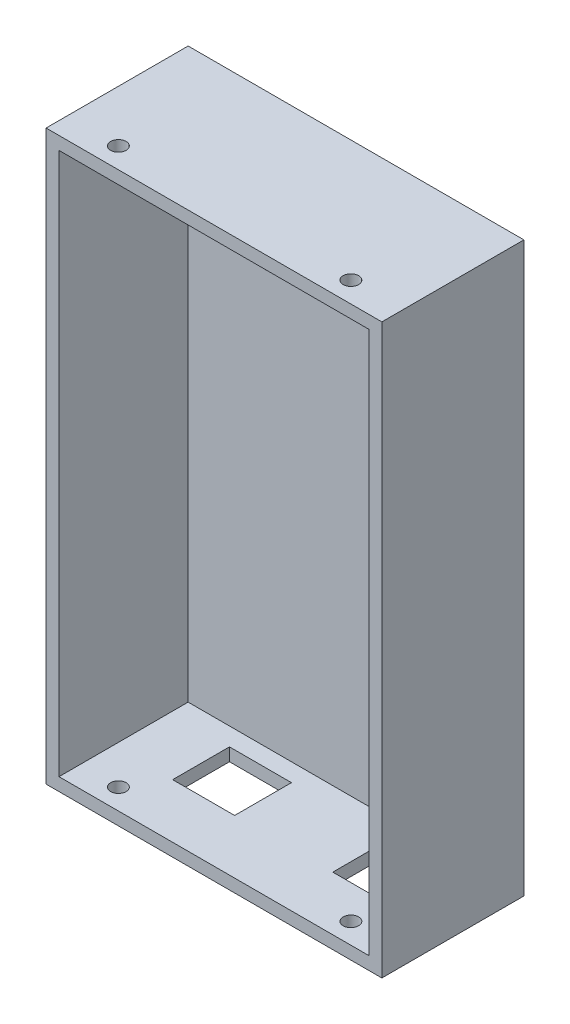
ISO-10303-21;
HEADER;
FILE_DESCRIPTION(('STEP AP214'),'2;1');
FILE_NAME('part.step','',(''),(''),'','','');
FILE_SCHEMA(('AUTOMOTIVE_DESIGN { 1 0 10303 214 1 1 1 1 }'));
ENDSEC;
DATA;
#1=APPLICATION_CONTEXT('core data for automotive mechanical design processes');
#2=APPLICATION_PROTOCOL_DEFINITION('international standard','automotive_design',2000,#1);
#3=PRODUCT_CONTEXT('',#1,'mechanical');
#4=PRODUCT('Part','Part','',(#3));
#5=PRODUCT_RELATED_PRODUCT_CATEGORY('part','',(#4));
#6=PRODUCT_DEFINITION_FORMATION('','',#4);
#7=PRODUCT_DEFINITION_CONTEXT('part definition',#1,'design');
#8=PRODUCT_DEFINITION('design','',#6,#7);
#9=PRODUCT_DEFINITION_SHAPE('','',#8);
#10=(LENGTH_UNIT() NAMED_UNIT(*) SI_UNIT(.MILLI.,.METRE.));
#11=(NAMED_UNIT(*) PLANE_ANGLE_UNIT() SI_UNIT($,.RADIAN.));
#12=(NAMED_UNIT(*) SI_UNIT($,.STERADIAN.) SOLID_ANGLE_UNIT());
#13=UNCERTAINTY_MEASURE_WITH_UNIT(LENGTH_MEASURE(1.E-05),#10,'distance_accuracy_value','');
#14=(GEOMETRIC_REPRESENTATION_CONTEXT(3) GLOBAL_UNCERTAINTY_ASSIGNED_CONTEXT((#13)) GLOBAL_UNIT_ASSIGNED_CONTEXT((#10,
#11,#12)) REPRESENTATION_CONTEXT('',''));
#15=CARTESIAN_POINT('',(0.,0.,0.));
#16=DIRECTION('',(0.,0.,1.));
#17=DIRECTION('',(1.,0.,0.));
#18=AXIS2_PLACEMENT_3D('',#15,#16,#17);
#19=CARTESIAN_POINT('',(32.5,55.,2.5));
#20=DIRECTION('',(-1.,0.,0.));
#21=DIRECTION('',(0.,-1.,0.));
#22=AXIS2_PLACEMENT_3D('',#19,#20,#21);
#23=PLANE('',#22);
#24=DIRECTION('',(0.,1.,0.));
#25=VECTOR('',#24,1.);
#26=CARTESIAN_POINT('',(32.5,55.,0.));
#27=LINE('',#26,#25);
#28=CARTESIAN_POINT('',(32.5,-55.,0.));
#29=VERTEX_POINT('',#28);
#30=CARTESIAN_POINT('',(32.5,55.,0.));
#31=VERTEX_POINT('',#30);
#32=EDGE_CURVE('E245',#29,#31,#27,.T.);
#33=ORIENTED_EDGE('',*,*,#32,.T.);
#34=DIRECTION('',(0.,0.,-1.));
#35=VECTOR('',#34,1.);
#36=CARTESIAN_POINT('',(32.5,55.,2.5));
#37=LINE('',#36,#35);
#38=CARTESIAN_POINT('',(32.5,55.,27.5));
#39=VERTEX_POINT('',#38);
#40=EDGE_CURVE('E263',#39,#31,#37,.T.);
#41=ORIENTED_EDGE('',*,*,#40,.F.);
#42=DIRECTION('',(0.,1.,0.));
#43=VECTOR('',#42,1.);
#44=CARTESIAN_POINT('',(32.5,-55.,27.5));
#45=LINE('',#44,#43);
#46=CARTESIAN_POINT('',(32.5,-55.,27.5));
#47=VERTEX_POINT('',#46);
#48=EDGE_CURVE('E242',#47,#39,#45,.T.);
#49=ORIENTED_EDGE('',*,*,#48,.F.);
#50=DIRECTION('',(0.,0.,-1.));
#51=VECTOR('',#50,1.);
#52=CARTESIAN_POINT('',(32.5,-55.,2.5));
#53=LINE('',#52,#51);
#54=EDGE_CURVE('E254',#47,#29,#53,.T.);
#55=ORIENTED_EDGE('',*,*,#54,.T.);
#56=EDGE_LOOP('',(#33,#41,#49,#55));
#57=FACE_BOUND('',#56,.T.);
#58=ADVANCED_FACE('F39',(#57),#23,.F.);
#59=CARTESIAN_POINT('',(-32.5,55.,2.5));
#60=DIRECTION('',(0.,-1.,0.));
#61=DIRECTION('',(0.,0.,-1.));
#62=AXIS2_PLACEMENT_3D('',#59,#60,#61);
#63=PLANE('',#62);
#64=CARTESIAN_POINT('',(-22.5,55.,23.5));
#65=DIRECTION('',(0.,-1.,0.));
#66=DIRECTION('',(0.,0.,-1.));
#67=AXIS2_PLACEMENT_3D('',#64,#65,#66);
#68=CIRCLE('',#67,1.5);
#69=CARTESIAN_POINT('',(-22.5,55.,22.));
#70=VERTEX_POINT('',#69);
#71=EDGE_CURVE('E281',#70,#70,#68,.T.);
#72=ORIENTED_EDGE('',*,*,#71,.T.);
#73=EDGE_LOOP('',(#72));
#74=FACE_BOUND('',#73,.T.);
#75=CARTESIAN_POINT('',(22.5,55.,23.5));
#76=DIRECTION('',(0.,-1.,0.));
#77=DIRECTION('',(0.,0.,-1.));
#78=AXIS2_PLACEMENT_3D('',#75,#76,#77);
#79=CIRCLE('',#78,1.5);
#80=CARTESIAN_POINT('',(22.5,55.,22.));
#81=VERTEX_POINT('',#80);
#82=EDGE_CURVE('E297',#81,#81,#79,.T.);
#83=ORIENTED_EDGE('',*,*,#82,.T.);
#84=EDGE_LOOP('',(#83));
#85=FACE_BOUND('',#84,.T.);
#86=DIRECTION('',(-1.,0.,0.));
#87=VECTOR('',#86,1.);
#88=CARTESIAN_POINT('',(-32.5,55.,0.));
#89=LINE('',#88,#87);
#90=CARTESIAN_POINT('',(-32.5,55.,0.));
#91=VERTEX_POINT('',#90);
#92=EDGE_CURVE('E248',#31,#91,#89,.T.);
#93=ORIENTED_EDGE('',*,*,#92,.T.);
#94=DIRECTION('',(0.,0.,-1.));
#95=VECTOR('',#94,1.);
#96=CARTESIAN_POINT('',(-32.5,55.,2.5));
#97=LINE('',#96,#95);
#98=CARTESIAN_POINT('',(-32.5,55.,27.5));
#99=VERTEX_POINT('',#98);
#100=EDGE_CURVE('E260',#99,#91,#97,.T.);
#101=ORIENTED_EDGE('',*,*,#100,.F.);
#102=DIRECTION('',(-1.,0.,0.));
#103=VECTOR('',#102,1.);
#104=CARTESIAN_POINT('',(32.5,55.,27.5));
#105=LINE('',#104,#103);
#106=EDGE_CURVE('E233',#39,#99,#105,.T.);
#107=ORIENTED_EDGE('',*,*,#106,.F.);
#108=ORIENTED_EDGE('',*,*,#40,.T.);
#109=EDGE_LOOP('',(#93,#101,#107,#108));
#110=FACE_BOUND('',#109,.T.);
#111=ADVANCED_FACE('F355',(#74,#85,#110),#63,.F.);
#112=CARTESIAN_POINT('',(-32.5,55.,2.5));
#113=DIRECTION('',(1.,0.,0.));
#114=DIRECTION('',(0.,1.,0.));
#115=AXIS2_PLACEMENT_3D('',#112,#113,#114);
#116=PLANE('',#115);
#117=DIRECTION('',(0.,-1.,0.));
#118=VECTOR('',#117,1.);
#119=CARTESIAN_POINT('',(-32.5,55.,0.));
#120=LINE('',#119,#118);
#121=CARTESIAN_POINT('',(-32.5,-55.,0.));
#122=VERTEX_POINT('',#121);
#123=EDGE_CURVE('E250',#91,#122,#120,.T.);
#124=ORIENTED_EDGE('',*,*,#123,.T.);
#125=DIRECTION('',(0.,0.,-1.));
#126=VECTOR('',#125,1.);
#127=CARTESIAN_POINT('',(-32.5,-55.,2.5));
#128=LINE('',#127,#126);
#129=CARTESIAN_POINT('',(-32.5,-55.,27.5));
#130=VERTEX_POINT('',#129);
#131=EDGE_CURVE('E257',#130,#122,#128,.T.);
#132=ORIENTED_EDGE('',*,*,#131,.F.);
#133=DIRECTION('',(0.,-1.,0.));
#134=VECTOR('',#133,1.);
#135=CARTESIAN_POINT('',(-32.5,55.,27.5));
#136=LINE('',#135,#134);
#137=EDGE_CURVE('E236',#99,#130,#136,.T.);
#138=ORIENTED_EDGE('',*,*,#137,.F.);
#139=ORIENTED_EDGE('',*,*,#100,.T.);
#140=EDGE_LOOP('',(#124,#132,#138,#139));
#141=FACE_BOUND('',#140,.T.);
#142=ADVANCED_FACE('F360',(#141),#116,.F.);
#143=CARTESIAN_POINT('',(-32.5,-55.,2.5));
#144=DIRECTION('',(0.,1.,0.));
#145=DIRECTION('',(0.,0.,1.));
#146=AXIS2_PLACEMENT_3D('',#143,#144,#145);
#147=PLANE('',#146);
#148=CARTESIAN_POINT('',(-22.5,-55.,23.5));
#149=DIRECTION('',(0.,-1.,0.));
#150=DIRECTION('',(0.,0.,-1.));
#151=AXIS2_PLACEMENT_3D('',#148,#149,#150);
#152=CIRCLE('',#151,1.5);
#153=CARTESIAN_POINT('',(-22.5,-55.,22.));
#154=VERTEX_POINT('',#153);
#155=EDGE_CURVE('E287',#154,#154,#152,.T.);
#156=ORIENTED_EDGE('',*,*,#155,.F.);
#157=EDGE_LOOP('',(#156));
#158=FACE_BOUND('',#157,.T.);
#159=CARTESIAN_POINT('',(22.5,-55.,23.5));
#160=DIRECTION('',(0.,-1.,0.));
#161=DIRECTION('',(0.,0.,-1.));
#162=AXIS2_PLACEMENT_3D('',#159,#160,#161);
#163=CIRCLE('',#162,1.5);
#164=CARTESIAN_POINT('',(22.5,-55.,22.));
#165=VERTEX_POINT('',#164);
#166=EDGE_CURVE('E292',#165,#165,#163,.T.);
#167=ORIENTED_EDGE('',*,*,#166,.F.);
#168=EDGE_LOOP('',(#167));
#169=FACE_BOUND('',#168,.T.);
#170=DIRECTION('',(-1.,0.,0.));
#171=VECTOR('',#170,1.);
#172=CARTESIAN_POINT('',(-18.5,-55.,17.));
#173=LINE('',#172,#171);
#174=CARTESIAN_POINT('',(-6.49999999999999,-55.,17.));
#175=VERTEX_POINT('',#174);
#176=CARTESIAN_POINT('',(-18.5,-55.,17.));
#177=VERTEX_POINT('',#176);
#178=EDGE_CURVE('E169',#175,#177,#173,.T.);
#179=ORIENTED_EDGE('',*,*,#178,.F.);
#180=DIRECTION('',(0.,0.,1.));
#181=VECTOR('',#180,1.);
#182=CARTESIAN_POINT('',(-6.49999999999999,-55.,17.));
#183=LINE('',#182,#181);
#184=CARTESIAN_POINT('',(-6.49999999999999,-55.,6.));
#185=VERTEX_POINT('',#184);
#186=EDGE_CURVE('E55',#185,#175,#183,.T.);
#187=ORIENTED_EDGE('',*,*,#186,.F.);
#188=DIRECTION('',(1.,0.,0.));
#189=VECTOR('',#188,1.);
#190=CARTESIAN_POINT('',(-18.5,-55.,6.));
#191=LINE('',#190,#189);
#192=CARTESIAN_POINT('',(-18.5,-55.,6.));
#193=VERTEX_POINT('',#192);
#194=EDGE_CURVE('E176',#193,#185,#191,.T.);
#195=ORIENTED_EDGE('',*,*,#194,.F.);
#196=DIRECTION('',(0.,0.,-1.));
#197=VECTOR('',#196,1.);
#198=CARTESIAN_POINT('',(-18.5,-55.,6.));
#199=LINE('',#198,#197);
#200=EDGE_CURVE('E159',#177,#193,#199,.T.);
#201=ORIENTED_EDGE('',*,*,#200,.F.);
#202=EDGE_LOOP('',(#179,#187,#195,#201));
#203=FACE_BOUND('',#202,.T.);
#204=DIRECTION('',(0.,0.,1.));
#205=VECTOR('',#204,1.);
#206=CARTESIAN_POINT('',(22.,-55.,6.));
#207=LINE('',#206,#205);
#208=CARTESIAN_POINT('',(22.,-55.,6.));
#209=VERTEX_POINT('',#208);
#210=CARTESIAN_POINT('',(22.,-55.,17.));
#211=VERTEX_POINT('',#210);
#212=EDGE_CURVE('E201',#209,#211,#207,.T.);
#213=ORIENTED_EDGE('',*,*,#212,.F.);
#214=DIRECTION('',(1.,0.,0.));
#215=VECTOR('',#214,1.);
#216=CARTESIAN_POINT('',(12.5,-55.,6.));
#217=LINE('',#216,#215);
#218=CARTESIAN_POINT('',(12.5,-55.,6.));
#219=VERTEX_POINT('',#218);
#220=EDGE_CURVE('E63',#219,#209,#217,.T.);
#221=ORIENTED_EDGE('',*,*,#220,.F.);
#222=DIRECTION('',(0.,0.,-1.));
#223=VECTOR('',#222,1.);
#224=CARTESIAN_POINT('',(12.5,-55.,17.));
#225=LINE('',#224,#223);
#226=CARTESIAN_POINT('',(12.5,-55.,17.));
#227=VERTEX_POINT('',#226);
#228=EDGE_CURVE('E188',#227,#219,#225,.T.);
#229=ORIENTED_EDGE('',*,*,#228,.F.);
#230=DIRECTION('',(-1.,0.,0.));
#231=VECTOR('',#230,1.);
#232=CARTESIAN_POINT('',(22.,-55.,17.));
#233=LINE('',#232,#231);
#234=EDGE_CURVE('E198',#211,#227,#233,.T.);
#235=ORIENTED_EDGE('',*,*,#234,.F.);
#236=EDGE_LOOP('',(#213,#221,#229,#235));
#237=FACE_BOUND('',#236,.T.);
#238=DIRECTION('',(1.,0.,0.));
#239=VECTOR('',#238,1.);
#240=CARTESIAN_POINT('',(-32.5,-55.,0.));
#241=LINE('',#240,#239);
#242=EDGE_CURVE('E252',#122,#29,#241,.T.);
#243=ORIENTED_EDGE('',*,*,#242,.T.);
#244=ORIENTED_EDGE('',*,*,#54,.F.);
#245=DIRECTION('',(1.,0.,0.));
#246=VECTOR('',#245,1.);
#247=CARTESIAN_POINT('',(-32.5,-55.,27.5));
#248=LINE('',#247,#246);
#249=EDGE_CURVE('E239',#130,#47,#248,.T.);
#250=ORIENTED_EDGE('',*,*,#249,.F.);
#251=ORIENTED_EDGE('',*,*,#131,.T.);
#252=EDGE_LOOP('',(#243,#244,#250,#251));
#253=FACE_BOUND('',#252,.T.);
#254=ADVANCED_FACE('F173',(#158,#169,#203,#237,#253),#147,.F.);
#255=CARTESIAN_POINT('',(0.,0.,0.));
#256=DIRECTION('',(0.,0.,1.));
#257=DIRECTION('',(1.,0.,0.));
#258=AXIS2_PLACEMENT_3D('',#255,#256,#257);
#259=PLANE('',#258);
#260=ORIENTED_EDGE('',*,*,#32,.F.);
#261=ORIENTED_EDGE('',*,*,#242,.F.);
#262=ORIENTED_EDGE('',*,*,#123,.F.);
#263=ORIENTED_EDGE('',*,*,#92,.F.);
#264=EDGE_LOOP('',(#260,#261,#262,#263));
#265=FACE_BOUND('',#264,.T.);
#266=ADVANCED_FACE('F350',(#265),#259,.F.);
#267=CARTESIAN_POINT('',(0.,0.,27.5));
#268=DIRECTION('',(0.,0.,1.));
#269=DIRECTION('',(1.,0.,0.));
#270=AXIS2_PLACEMENT_3D('',#267,#268,#269);
#271=PLANE('',#270);
#272=ORIENTED_EDGE('',*,*,#106,.T.);
#273=ORIENTED_EDGE('',*,*,#137,.T.);
#274=ORIENTED_EDGE('',*,*,#249,.T.);
#275=ORIENTED_EDGE('',*,*,#48,.T.);
#276=EDGE_LOOP('',(#272,#273,#274,#275));
#277=FACE_BOUND('',#276,.T.);
#278=DIRECTION('',(0.,-1.,0.));
#279=VECTOR('',#278,1.);
#280=CARTESIAN_POINT('',(-30.,52.5,27.5));
#281=LINE('',#280,#279);
#282=CARTESIAN_POINT('',(-30.,52.5,27.5));
#283=VERTEX_POINT('',#282);
#284=CARTESIAN_POINT('',(-30.,-52.5,27.5));
#285=VERTEX_POINT('',#284);
#286=EDGE_CURVE('E207',#283,#285,#281,.T.);
#287=ORIENTED_EDGE('',*,*,#286,.F.);
#288=DIRECTION('',(-1.,0.,0.));
#289=VECTOR('',#288,1.);
#290=CARTESIAN_POINT('',(30.,52.5,27.5));
#291=LINE('',#290,#289);
#292=CARTESIAN_POINT('',(30.,52.5,27.5));
#293=VERTEX_POINT('',#292);
#294=EDGE_CURVE('E205',#293,#283,#291,.T.);
#295=ORIENTED_EDGE('',*,*,#294,.F.);
#296=DIRECTION('',(0.,1.,0.));
#297=VECTOR('',#296,1.);
#298=CARTESIAN_POINT('',(30.,-52.5,27.5));
#299=LINE('',#298,#297);
#300=CARTESIAN_POINT('',(30.,-52.5,27.5));
#301=VERTEX_POINT('',#300);
#302=EDGE_CURVE('E213',#301,#293,#299,.T.);
#303=ORIENTED_EDGE('',*,*,#302,.F.);
#304=DIRECTION('',(1.,0.,0.));
#305=VECTOR('',#304,1.);
#306=CARTESIAN_POINT('',(-30.,-52.5,27.5));
#307=LINE('',#306,#305);
#308=EDGE_CURVE('E210',#285,#301,#307,.T.);
#309=ORIENTED_EDGE('',*,*,#308,.F.);
#310=EDGE_LOOP('',(#287,#295,#303,#309));
#311=FACE_BOUND('',#310,.T.);
#312=ADVANCED_FACE('F336',(#277,#311),#271,.T.);
#313=CARTESIAN_POINT('',(30.,52.5,27.5));
#314=DIRECTION('',(0.,-1.,0.));
#315=DIRECTION('',(0.,0.,-1.));
#316=AXIS2_PLACEMENT_3D('',#313,#314,#315);
#317=PLANE('',#316);
#318=CARTESIAN_POINT('',(-22.5,52.5,23.5));
#319=DIRECTION('',(0.,-1.,0.));
#320=DIRECTION('',(0.,0.,-1.));
#321=AXIS2_PLACEMENT_3D('',#318,#319,#320);
#322=CIRCLE('',#321,1.5);
#323=CARTESIAN_POINT('',(-22.5,52.5,22.));
#324=VERTEX_POINT('',#323);
#325=EDGE_CURVE('E195',#324,#324,#322,.T.);
#326=ORIENTED_EDGE('',*,*,#325,.F.);
#327=EDGE_LOOP('',(#326));
#328=FACE_BOUND('',#327,.T.);
#329=CARTESIAN_POINT('',(22.5,52.5,23.5));
#330=DIRECTION('',(0.,-1.,0.));
#331=DIRECTION('',(0.,0.,-1.));
#332=AXIS2_PLACEMENT_3D('',#329,#330,#331);
#333=CIRCLE('',#332,1.5);
#334=CARTESIAN_POINT('',(22.5,52.5,22.));
#335=VERTEX_POINT('',#334);
#336=EDGE_CURVE('E280',#335,#335,#333,.T.);
#337=ORIENTED_EDGE('',*,*,#336,.F.);
#338=EDGE_LOOP('',(#337));
#339=FACE_BOUND('',#338,.T.);
#340=DIRECTION('',(-1.,0.,0.));
#341=VECTOR('',#340,1.);
#342=CARTESIAN_POINT('',(30.,52.5,2.5));
#343=LINE('',#342,#341);
#344=CARTESIAN_POINT('',(30.,52.5,2.5));
#345=VERTEX_POINT('',#344);
#346=CARTESIAN_POINT('',(-30.,52.5,2.5));
#347=VERTEX_POINT('',#346);
#348=EDGE_CURVE('E183',#345,#347,#343,.T.);
#349=ORIENTED_EDGE('',*,*,#348,.F.);
#350=DIRECTION('',(0.,0.,-1.));
#351=VECTOR('',#350,1.);
#352=CARTESIAN_POINT('',(30.,52.5,27.5));
#353=LINE('',#352,#351);
#354=EDGE_CURVE('E215',#293,#345,#353,.T.);
#355=ORIENTED_EDGE('',*,*,#354,.F.);
#356=ORIENTED_EDGE('',*,*,#294,.T.);
#357=DIRECTION('',(0.,0.,-1.));
#358=VECTOR('',#357,1.);
#359=CARTESIAN_POINT('',(-30.,52.5,27.5));
#360=LINE('',#359,#358);
#361=EDGE_CURVE('E230',#283,#347,#360,.T.);
#362=ORIENTED_EDGE('',*,*,#361,.T.);
#363=EDGE_LOOP('',(#349,#355,#356,#362));
#364=FACE_BOUND('',#363,.T.);
#365=ADVANCED_FACE('F341',(#328,#339,#364),#317,.T.);
#366=CARTESIAN_POINT('',(-30.,52.5,27.5));
#367=DIRECTION('',(1.,0.,0.));
#368=DIRECTION('',(0.,1.,0.));
#369=AXIS2_PLACEMENT_3D('',#366,#367,#368);
#370=PLANE('',#369);
#371=DIRECTION('',(0.,-1.,0.));
#372=VECTOR('',#371,1.);
#373=CARTESIAN_POINT('',(-30.,52.5,2.5));
#374=LINE('',#373,#372);
#375=CARTESIAN_POINT('',(-30.,-52.5,2.5));
#376=VERTEX_POINT('',#375);
#377=EDGE_CURVE('E217',#347,#376,#374,.T.);
#378=ORIENTED_EDGE('',*,*,#377,.F.);
#379=ORIENTED_EDGE('',*,*,#361,.F.);
#380=ORIENTED_EDGE('',*,*,#286,.T.);
#381=DIRECTION('',(0.,0.,-1.));
#382=VECTOR('',#381,1.);
#383=CARTESIAN_POINT('',(-30.,-52.5,27.5));
#384=LINE('',#383,#382);
#385=EDGE_CURVE('E227',#285,#376,#384,.T.);
#386=ORIENTED_EDGE('',*,*,#385,.T.);
#387=EDGE_LOOP('',(#378,#379,#380,#386));
#388=FACE_BOUND('',#387,.T.);
#389=ADVANCED_FACE('F313',(#388),#370,.T.);
#390=CARTESIAN_POINT('',(-30.,-52.5,27.5));
#391=DIRECTION('',(0.,1.,0.));
#392=DIRECTION('',(0.,0.,1.));
#393=AXIS2_PLACEMENT_3D('',#390,#391,#392);
#394=PLANE('',#393);
#395=CARTESIAN_POINT('',(-22.5,-52.5,23.5));
#396=DIRECTION('',(0.,1.,0.));
#397=DIRECTION('',(0.,0.,1.));
#398=AXIS2_PLACEMENT_3D('',#395,#396,#397);
#399=CIRCLE('',#398,1.5);
#400=CARTESIAN_POINT('',(-22.5,-52.5,25.));
#401=VERTEX_POINT('',#400);
#402=EDGE_CURVE('E42',#401,#401,#399,.T.);
#403=ORIENTED_EDGE('',*,*,#402,.F.);
#404=EDGE_LOOP('',(#403));
#405=FACE_BOUND('',#404,.T.);
#406=CARTESIAN_POINT('',(22.5,-52.5,23.5));
#407=DIRECTION('',(0.,1.,0.));
#408=DIRECTION('',(0.,0.,1.));
#409=AXIS2_PLACEMENT_3D('',#406,#407,#408);
#410=CIRCLE('',#409,1.5);
#411=CARTESIAN_POINT('',(22.5,-52.5,25.));
#412=VERTEX_POINT('',#411);
#413=EDGE_CURVE('E278',#412,#412,#410,.T.);
#414=ORIENTED_EDGE('',*,*,#413,.F.);
#415=EDGE_LOOP('',(#414));
#416=FACE_BOUND('',#415,.T.);
#417=DIRECTION('',(0.,0.,-1.));
#418=VECTOR('',#417,1.);
#419=CARTESIAN_POINT('',(-6.49999999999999,-52.5,27.5));
#420=LINE('',#419,#418);
#421=CARTESIAN_POINT('',(-6.49999999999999,-52.5,17.));
#422=VERTEX_POINT('',#421);
#423=CARTESIAN_POINT('',(-6.49999999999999,-52.5,6.));
#424=VERTEX_POINT('',#423);
#425=EDGE_CURVE('E11',#422,#424,#420,.T.);
#426=ORIENTED_EDGE('',*,*,#425,.F.);
#427=DIRECTION('',(1.,0.,0.));
#428=VECTOR('',#427,1.);
#429=CARTESIAN_POINT('',(-30.,-52.5,17.));
#430=LINE('',#429,#428);
#431=CARTESIAN_POINT('',(-18.5,-52.5,17.));
#432=VERTEX_POINT('',#431);
#433=EDGE_CURVE('E275',#432,#422,#430,.T.);
#434=ORIENTED_EDGE('',*,*,#433,.F.);
#435=DIRECTION('',(0.,0.,1.));
#436=VECTOR('',#435,1.);
#437=CARTESIAN_POINT('',(-18.5,-52.5,27.5));
#438=LINE('',#437,#436);
#439=CARTESIAN_POINT('',(-18.5,-52.5,6.));
#440=VERTEX_POINT('',#439);
#441=EDGE_CURVE('E162',#440,#432,#438,.T.);
#442=ORIENTED_EDGE('',*,*,#441,.F.);
#443=DIRECTION('',(-1.,0.,0.));
#444=VECTOR('',#443,1.);
#445=CARTESIAN_POINT('',(-30.,-52.5,6.));
#446=LINE('',#445,#444);
#447=EDGE_CURVE('E47',#424,#440,#446,.T.);
#448=ORIENTED_EDGE('',*,*,#447,.F.);
#449=EDGE_LOOP('',(#426,#434,#442,#448));
#450=FACE_BOUND('',#449,.T.);
#451=DIRECTION('',(-1.,0.,0.));
#452=VECTOR('',#451,1.);
#453=CARTESIAN_POINT('',(-30.,-52.5,6.));
#454=LINE('',#453,#452);
#455=CARTESIAN_POINT('',(22.,-52.5,6.));
#456=VERTEX_POINT('',#455);
#457=CARTESIAN_POINT('',(12.5,-52.5,6.));
#458=VERTEX_POINT('',#457);
#459=EDGE_CURVE('E273',#456,#458,#454,.T.);
#460=ORIENTED_EDGE('',*,*,#459,.F.);
#461=DIRECTION('',(0.,0.,-1.));
#462=VECTOR('',#461,1.);
#463=CARTESIAN_POINT('',(22.,-52.5,27.5));
#464=LINE('',#463,#462);
#465=CARTESIAN_POINT('',(22.,-52.5,17.));
#466=VERTEX_POINT('',#465);
#467=EDGE_CURVE('E266',#466,#456,#464,.T.);
#468=ORIENTED_EDGE('',*,*,#467,.F.);
#469=DIRECTION('',(1.,0.,0.));
#470=VECTOR('',#469,1.);
#471=CARTESIAN_POINT('',(-30.,-52.5,17.));
#472=LINE('',#471,#470);
#473=CARTESIAN_POINT('',(12.5,-52.5,17.));
#474=VERTEX_POINT('',#473);
#475=EDGE_CURVE('E268',#474,#466,#472,.T.);
#476=ORIENTED_EDGE('',*,*,#475,.F.);
#477=DIRECTION('',(0.,0.,1.));
#478=VECTOR('',#477,1.);
#479=CARTESIAN_POINT('',(12.5,-52.5,27.5));
#480=LINE('',#479,#478);
#481=EDGE_CURVE('E271',#458,#474,#480,.T.);
#482=ORIENTED_EDGE('',*,*,#481,.F.);
#483=EDGE_LOOP('',(#460,#468,#476,#482));
#484=FACE_BOUND('',#483,.T.);
#485=DIRECTION('',(1.,0.,0.));
#486=VECTOR('',#485,1.);
#487=CARTESIAN_POINT('',(-30.,-52.5,2.5));
#488=LINE('',#487,#486);
#489=CARTESIAN_POINT('',(30.,-52.5,2.5));
#490=VERTEX_POINT('',#489);
#491=EDGE_CURVE('E219',#376,#490,#488,.T.);
#492=ORIENTED_EDGE('',*,*,#491,.F.);
#493=ORIENTED_EDGE('',*,*,#385,.F.);
#494=ORIENTED_EDGE('',*,*,#308,.T.);
#495=DIRECTION('',(0.,0.,-1.));
#496=VECTOR('',#495,1.);
#497=CARTESIAN_POINT('',(30.,-52.5,27.5));
#498=LINE('',#497,#496);
#499=EDGE_CURVE('E224',#301,#490,#498,.T.);
#500=ORIENTED_EDGE('',*,*,#499,.T.);
#501=EDGE_LOOP('',(#492,#493,#494,#500));
#502=FACE_BOUND('',#501,.T.);
#503=ADVANCED_FACE('F309',(#405,#416,#450,#484,#502),#394,.T.);
#504=CARTESIAN_POINT('',(30.,-52.5,27.5));
#505=DIRECTION('',(-1.,0.,0.));
#506=DIRECTION('',(0.,-1.,0.));
#507=AXIS2_PLACEMENT_3D('',#504,#505,#506);
#508=PLANE('',#507);
#509=DIRECTION('',(0.,1.,0.));
#510=VECTOR('',#509,1.);
#511=CARTESIAN_POINT('',(30.,-52.5,2.5));
#512=LINE('',#511,#510);
#513=EDGE_CURVE('E208',#490,#345,#512,.T.);
#514=ORIENTED_EDGE('',*,*,#513,.F.);
#515=ORIENTED_EDGE('',*,*,#499,.F.);
#516=ORIENTED_EDGE('',*,*,#302,.T.);
#517=ORIENTED_EDGE('',*,*,#354,.T.);
#518=EDGE_LOOP('',(#514,#515,#516,#517));
#519=FACE_BOUND('',#518,.T.);
#520=ADVANCED_FACE('F312',(#519),#508,.T.);
#521=CARTESIAN_POINT('',(0.,0.,2.5));
#522=DIRECTION('',(0.,0.,1.));
#523=DIRECTION('',(1.,0.,0.));
#524=AXIS2_PLACEMENT_3D('',#521,#522,#523);
#525=PLANE('',#524);
#526=ORIENTED_EDGE('',*,*,#348,.T.);
#527=ORIENTED_EDGE('',*,*,#377,.T.);
#528=ORIENTED_EDGE('',*,*,#491,.T.);
#529=ORIENTED_EDGE('',*,*,#513,.T.);
#530=EDGE_LOOP('',(#526,#527,#528,#529));
#531=FACE_BOUND('',#530,.T.);
#532=ADVANCED_FACE('F328',(#531),#525,.T.);
#533=CARTESIAN_POINT('',(12.5,-38.,6.));
#534=DIRECTION('',(0.,0.,-1.));
#535=DIRECTION('',(-1.,0.,0.));
#536=AXIS2_PLACEMENT_3D('',#533,#534,#535);
#537=PLANE('',#536);
#538=ORIENTED_EDGE('',*,*,#459,.T.);
#539=DIRECTION('',(0.,-1.,0.));
#540=VECTOR('',#539,1.);
#541=CARTESIAN_POINT('',(12.5,-38.,6.));
#542=LINE('',#541,#540);
#543=EDGE_CURVE('E193',#458,#219,#542,.T.);
#544=ORIENTED_EDGE('',*,*,#543,.T.);
#545=ORIENTED_EDGE('',*,*,#220,.T.);
#546=DIRECTION('',(0.,-1.,0.));
#547=VECTOR('',#546,1.);
#548=CARTESIAN_POINT('',(22.,-38.,6.));
#549=LINE('',#548,#547);
#550=EDGE_CURVE('E186',#456,#209,#549,.T.);
#551=ORIENTED_EDGE('',*,*,#550,.F.);
#552=EDGE_LOOP('',(#538,#544,#545,#551));
#553=FACE_BOUND('',#552,.T.);
#554=ADVANCED_FACE('F383',(#553),#537,.F.);
#555=CARTESIAN_POINT('',(12.5,-38.,17.));
#556=DIRECTION('',(-1.,0.,0.));
#557=DIRECTION('',(0.,0.,1.));
#558=AXIS2_PLACEMENT_3D('',#555,#556,#557);
#559=PLANE('',#558);
#560=ORIENTED_EDGE('',*,*,#481,.T.);
#561=DIRECTION('',(0.,-1.,0.));
#562=VECTOR('',#561,1.);
#563=CARTESIAN_POINT('',(12.5,-38.,17.));
#564=LINE('',#563,#562);
#565=EDGE_CURVE('E191',#474,#227,#564,.T.);
#566=ORIENTED_EDGE('',*,*,#565,.T.);
#567=ORIENTED_EDGE('',*,*,#228,.T.);
#568=ORIENTED_EDGE('',*,*,#543,.F.);
#569=EDGE_LOOP('',(#560,#566,#567,#568));
#570=FACE_BOUND('',#569,.T.);
#571=ADVANCED_FACE('F388',(#570),#559,.F.);
#572=CARTESIAN_POINT('',(22.,-38.,17.));
#573=DIRECTION('',(0.,0.,1.));
#574=DIRECTION('',(1.,0.,0.));
#575=AXIS2_PLACEMENT_3D('',#572,#573,#574);
#576=PLANE('',#575);
#577=ORIENTED_EDGE('',*,*,#475,.T.);
#578=DIRECTION('',(0.,-1.,0.));
#579=VECTOR('',#578,1.);
#580=CARTESIAN_POINT('',(22.,-38.,17.));
#581=LINE('',#580,#579);
#582=EDGE_CURVE('E189',#466,#211,#581,.T.);
#583=ORIENTED_EDGE('',*,*,#582,.T.);
#584=ORIENTED_EDGE('',*,*,#234,.T.);
#585=ORIENTED_EDGE('',*,*,#565,.F.);
#586=EDGE_LOOP('',(#577,#583,#584,#585));
#587=FACE_BOUND('',#586,.T.);
#588=ADVANCED_FACE('F396',(#587),#576,.F.);
#589=CARTESIAN_POINT('',(22.,-38.,6.));
#590=DIRECTION('',(1.,0.,0.));
#591=DIRECTION('',(0.,0.,-1.));
#592=AXIS2_PLACEMENT_3D('',#589,#590,#591);
#593=PLANE('',#592);
#594=ORIENTED_EDGE('',*,*,#467,.T.);
#595=ORIENTED_EDGE('',*,*,#550,.T.);
#596=ORIENTED_EDGE('',*,*,#212,.T.);
#597=ORIENTED_EDGE('',*,*,#582,.F.);
#598=EDGE_LOOP('',(#594,#595,#596,#597));
#599=FACE_BOUND('',#598,.T.);
#600=ADVANCED_FACE('F400',(#599),#593,.F.);
#601=CARTESIAN_POINT('',(-6.49999999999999,-38.,17.));
#602=DIRECTION('',(1.,0.,0.));
#603=DIRECTION('',(0.,0.,-1.));
#604=AXIS2_PLACEMENT_3D('',#601,#602,#603);
#605=PLANE('',#604);
#606=ORIENTED_EDGE('',*,*,#425,.T.);
#607=DIRECTION('',(0.,-1.,0.));
#608=VECTOR('',#607,1.);
#609=CARTESIAN_POINT('',(-6.49999999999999,-38.,6.));
#610=LINE('',#609,#608);
#611=EDGE_CURVE('E181',#424,#185,#610,.T.);
#612=ORIENTED_EDGE('',*,*,#611,.T.);
#613=ORIENTED_EDGE('',*,*,#186,.T.);
#614=DIRECTION('',(0.,-1.,0.));
#615=VECTOR('',#614,1.);
#616=CARTESIAN_POINT('',(-6.49999999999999,-38.,17.));
#617=LINE('',#616,#615);
#618=EDGE_CURVE('E166',#422,#175,#617,.T.);
#619=ORIENTED_EDGE('',*,*,#618,.F.);
#620=EDGE_LOOP('',(#606,#612,#613,#619));
#621=FACE_BOUND('',#620,.T.);
#622=ADVANCED_FACE('F403',(#621),#605,.F.);
#623=CARTESIAN_POINT('',(-18.5,-38.,6.));
#624=DIRECTION('',(0.,0.,-1.));
#625=DIRECTION('',(-1.,0.,0.));
#626=AXIS2_PLACEMENT_3D('',#623,#624,#625);
#627=PLANE('',#626);
#628=ORIENTED_EDGE('',*,*,#447,.T.);
#629=DIRECTION('',(0.,-1.,0.));
#630=VECTOR('',#629,1.);
#631=CARTESIAN_POINT('',(-18.5,-38.,6.));
#632=LINE('',#631,#630);
#633=EDGE_CURVE('E165',#440,#193,#632,.T.);
#634=ORIENTED_EDGE('',*,*,#633,.T.);
#635=ORIENTED_EDGE('',*,*,#194,.T.);
#636=ORIENTED_EDGE('',*,*,#611,.F.);
#637=EDGE_LOOP('',(#628,#634,#635,#636));
#638=FACE_BOUND('',#637,.T.);
#639=ADVANCED_FACE('F408',(#638),#627,.F.);
#640=CARTESIAN_POINT('',(-18.5,-38.,6.));
#641=DIRECTION('',(-1.,0.,0.));
#642=DIRECTION('',(0.,0.,1.));
#643=AXIS2_PLACEMENT_3D('',#640,#641,#642);
#644=PLANE('',#643);
#645=ORIENTED_EDGE('',*,*,#441,.T.);
#646=DIRECTION('',(0.,-1.,0.));
#647=VECTOR('',#646,1.);
#648=CARTESIAN_POINT('',(-18.5,-38.,17.));
#649=LINE('',#648,#647);
#650=EDGE_CURVE('E154',#432,#177,#649,.T.);
#651=ORIENTED_EDGE('',*,*,#650,.T.);
#652=ORIENTED_EDGE('',*,*,#200,.T.);
#653=ORIENTED_EDGE('',*,*,#633,.F.);
#654=EDGE_LOOP('',(#645,#651,#652,#653));
#655=FACE_BOUND('',#654,.T.);
#656=ADVANCED_FACE('F156',(#655),#644,.F.);
#657=CARTESIAN_POINT('',(-18.5,-38.,17.));
#658=DIRECTION('',(0.,0.,1.));
#659=DIRECTION('',(1.,0.,0.));
#660=AXIS2_PLACEMENT_3D('',#657,#658,#659);
#661=PLANE('',#660);
#662=ORIENTED_EDGE('',*,*,#433,.T.);
#663=ORIENTED_EDGE('',*,*,#618,.T.);
#664=ORIENTED_EDGE('',*,*,#178,.T.);
#665=ORIENTED_EDGE('',*,*,#650,.F.);
#666=EDGE_LOOP('',(#662,#663,#664,#665));
#667=FACE_BOUND('',#666,.T.);
#668=ADVANCED_FACE('F170',(#667),#661,.F.);
#669=CARTESIAN_POINT('',(22.5,55.,23.5));
#670=DIRECTION('',(0.,-1.,0.));
#671=DIRECTION('',(0.,0.,-1.));
#672=AXIS2_PLACEMENT_3D('',#669,#670,#671);
#673=CYLINDRICAL_SURFACE('',#672,1.5);
#674=ORIENTED_EDGE('',*,*,#413,.T.);
#675=EDGE_LOOP('',(#674));
#676=FACE_BOUND('',#675,.T.);
#677=ORIENTED_EDGE('',*,*,#166,.T.);
#678=EDGE_LOOP('',(#677));
#679=FACE_BOUND('',#678,.T.);
#680=ADVANCED_FACE('F411',(#676,#679),#673,.F.);
#681=CARTESIAN_POINT('',(-22.5,55.,23.5));
#682=DIRECTION('',(0.,-1.,0.));
#683=DIRECTION('',(0.,0.,-1.));
#684=AXIS2_PLACEMENT_3D('',#681,#682,#683);
#685=CYLINDRICAL_SURFACE('',#684,1.5);
#686=ORIENTED_EDGE('',*,*,#402,.T.);
#687=EDGE_LOOP('',(#686));
#688=FACE_BOUND('',#687,.T.);
#689=ORIENTED_EDGE('',*,*,#155,.T.);
#690=EDGE_LOOP('',(#689));
#691=FACE_BOUND('',#690,.T.);
#692=ADVANCED_FACE('F306',(#688,#691),#685,.F.);
#693=ORIENTED_EDGE('',*,*,#336,.T.);
#694=EDGE_LOOP('',(#693));
#695=FACE_BOUND('',#694,.T.);
#696=ORIENTED_EDGE('',*,*,#82,.F.);
#697=EDGE_LOOP('',(#696));
#698=FACE_BOUND('',#697,.T.);
#699=ADVANCED_FACE('F419',(#695,#698),#673,.F.);
#700=ORIENTED_EDGE('',*,*,#325,.T.);
#701=EDGE_LOOP('',(#700));
#702=FACE_BOUND('',#701,.T.);
#703=ORIENTED_EDGE('',*,*,#71,.F.);
#704=EDGE_LOOP('',(#703));
#705=FACE_BOUND('',#704,.T.);
#706=ADVANCED_FACE('F421',(#702,#705),#685,.F.);
#707=CLOSED_SHELL('',(#58,#111,#142,#254,#266,#312,#365,#389,#503,#520,#532,#554,#571,#588,#600,
#622,#639,#656,#668,#680,#692,#699,#706));
#708=MANIFOLD_SOLID_BREP('B2',#707);
#709=ADVANCED_BREP_SHAPE_REPRESENTATION('',(#18,#708),#14);
#710=SHAPE_DEFINITION_REPRESENTATION(#9,#709);
ENDSEC;
END-ISO-10303-21;
